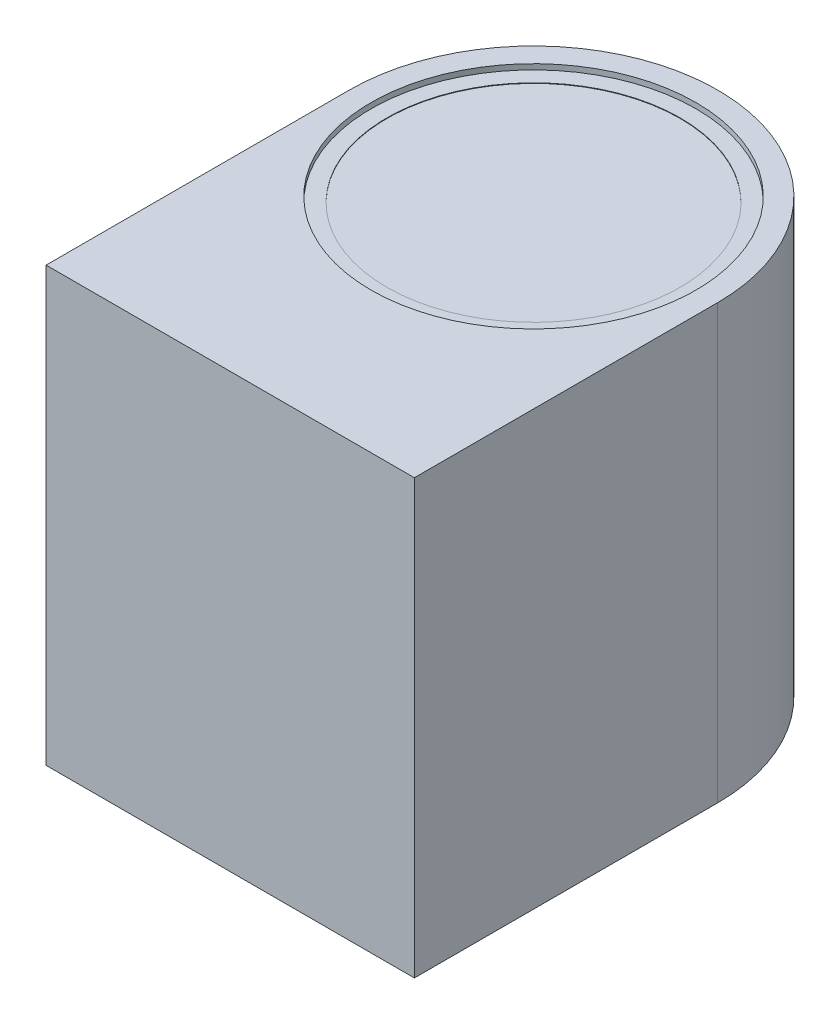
ISO-10303-21;
HEADER;
FILE_DESCRIPTION(('STEP AP214'),'2;1');
FILE_NAME('part.step','',(''),(''),'','','');
FILE_SCHEMA(('AUTOMOTIVE_DESIGN { 1 0 10303 214 1 1 1 1 }'));
ENDSEC;
DATA;
#1=APPLICATION_CONTEXT('core data for automotive mechanical design processes');
#2=APPLICATION_PROTOCOL_DEFINITION('international standard','automotive_design',2000,#1);
#3=PRODUCT_CONTEXT('',#1,'mechanical');
#4=PRODUCT('Part','Part','',(#3));
#5=PRODUCT_RELATED_PRODUCT_CATEGORY('part','',(#4));
#6=PRODUCT_DEFINITION_FORMATION('','',#4);
#7=PRODUCT_DEFINITION_CONTEXT('part definition',#1,'design');
#8=PRODUCT_DEFINITION('design','',#6,#7);
#9=PRODUCT_DEFINITION_SHAPE('','',#8);
#10=(LENGTH_UNIT() NAMED_UNIT(*) SI_UNIT(.MILLI.,.METRE.));
#11=(NAMED_UNIT(*) PLANE_ANGLE_UNIT() SI_UNIT($,.RADIAN.));
#12=(NAMED_UNIT(*) SI_UNIT($,.STERADIAN.) SOLID_ANGLE_UNIT());
#13=UNCERTAINTY_MEASURE_WITH_UNIT(LENGTH_MEASURE(1.E-05),#10,'distance_accuracy_value','');
#14=(GEOMETRIC_REPRESENTATION_CONTEXT(3) GLOBAL_UNCERTAINTY_ASSIGNED_CONTEXT((#13)) GLOBAL_UNIT_ASSIGNED_CONTEXT((#10,
#11,#12)) REPRESENTATION_CONTEXT('',''));
#15=CARTESIAN_POINT('',(0.,0.,0.));
#16=DIRECTION('',(0.,0.,1.));
#17=DIRECTION('',(1.,0.,0.));
#18=AXIS2_PLACEMENT_3D('',#15,#16,#17);
#19=CARTESIAN_POINT('',(0.,80.,0.));
#20=DIRECTION('',(0.,-1.,0.));
#21=DIRECTION('',(0.,0.,-1.));
#22=AXIS2_PLACEMENT_3D('',#19,#20,#21);
#23=CYLINDRICAL_SURFACE('',#22,34.);
#24=CARTESIAN_POINT('',(0.,0.,0.));
#25=DIRECTION('',(0.,1.,0.));
#26=DIRECTION('',(0.,0.,1.));
#27=AXIS2_PLACEMENT_3D('',#24,#25,#26);
#28=CIRCLE('',#27,34.);
#29=CARTESIAN_POINT('',(34.,0.,0.));
#30=VERTEX_POINT('',#29);
#31=CARTESIAN_POINT('',(-34.,0.,0.));
#32=VERTEX_POINT('',#31);
#33=EDGE_CURVE('E107',#30,#32,#28,.T.);
#34=ORIENTED_EDGE('',*,*,#33,.T.);
#35=DIRECTION('',(0.,-1.,0.));
#36=VECTOR('',#35,1.);
#37=CARTESIAN_POINT('',(-34.,80.,0.));
#38=LINE('',#37,#36);
#39=CARTESIAN_POINT('',(-34.,80.,0.));
#40=VERTEX_POINT('',#39);
#41=EDGE_CURVE('E11',#40,#32,#38,.T.);
#42=ORIENTED_EDGE('',*,*,#41,.F.);
#43=CARTESIAN_POINT('',(0.,80.,0.));
#44=DIRECTION('',(0.,1.,0.));
#45=DIRECTION('',(0.,0.,1.));
#46=AXIS2_PLACEMENT_3D('',#43,#44,#45);
#47=CIRCLE('',#46,34.);
#48=CARTESIAN_POINT('',(34.,80.,0.));
#49=VERTEX_POINT('',#48);
#50=EDGE_CURVE('E91',#49,#40,#47,.T.);
#51=ORIENTED_EDGE('',*,*,#50,.F.);
#52=DIRECTION('',(0.,-1.,0.));
#53=VECTOR('',#52,1.);
#54=CARTESIAN_POINT('',(34.,80.,0.));
#55=LINE('',#54,#53);
#56=EDGE_CURVE('E103',#49,#30,#55,.T.);
#57=ORIENTED_EDGE('',*,*,#56,.T.);
#58=EDGE_LOOP('',(#34,#42,#51,#57));
#59=FACE_BOUND('',#58,.T.);
#60=ADVANCED_FACE('F39',(#59),#23,.T.);
#61=CARTESIAN_POINT('',(-34.,80.,0.));
#62=DIRECTION('',(1.,0.,0.));
#63=DIRECTION('',(0.,0.,-1.));
#64=AXIS2_PLACEMENT_3D('',#61,#62,#63);
#65=PLANE('',#64);
#66=DIRECTION('',(0.,0.,1.));
#67=VECTOR('',#66,1.);
#68=CARTESIAN_POINT('',(-34.,0.,0.));
#69=LINE('',#68,#67);
#70=CARTESIAN_POINT('',(-34.,0.,56.));
#71=VERTEX_POINT('',#70);
#72=EDGE_CURVE('E96',#32,#71,#69,.T.);
#73=ORIENTED_EDGE('',*,*,#72,.T.);
#74=DIRECTION('',(0.,-1.,0.));
#75=VECTOR('',#74,1.);
#76=CARTESIAN_POINT('',(-34.,80.,56.));
#77=LINE('',#76,#75);
#78=CARTESIAN_POINT('',(-34.,80.,56.));
#79=VERTEX_POINT('',#78);
#80=EDGE_CURVE('E48',#79,#71,#77,.T.);
#81=ORIENTED_EDGE('',*,*,#80,.F.);
#82=DIRECTION('',(0.,0.,1.));
#83=VECTOR('',#82,1.);
#84=CARTESIAN_POINT('',(-34.,80.,0.));
#85=LINE('',#84,#83);
#86=EDGE_CURVE('E86',#40,#79,#85,.T.);
#87=ORIENTED_EDGE('',*,*,#86,.F.);
#88=ORIENTED_EDGE('',*,*,#41,.T.);
#89=EDGE_LOOP('',(#73,#81,#87,#88));
#90=FACE_BOUND('',#89,.T.);
#91=ADVANCED_FACE('F95',(#90),#65,.F.);
#92=CARTESIAN_POINT('',(-34.,80.,56.));
#93=DIRECTION('',(0.,0.,-1.));
#94=DIRECTION('',(-1.,0.,0.));
#95=AXIS2_PLACEMENT_3D('',#92,#93,#94);
#96=PLANE('',#95);
#97=DIRECTION('',(1.,0.,0.));
#98=VECTOR('',#97,1.);
#99=CARTESIAN_POINT('',(-34.,0.,56.));
#100=LINE('',#99,#98);
#101=CARTESIAN_POINT('',(34.,0.,56.));
#102=VERTEX_POINT('',#101);
#103=EDGE_CURVE('E73',#71,#102,#100,.T.);
#104=ORIENTED_EDGE('',*,*,#103,.T.);
#105=DIRECTION('',(0.,-1.,0.));
#106=VECTOR('',#105,1.);
#107=CARTESIAN_POINT('',(34.,80.,56.));
#108=LINE('',#107,#106);
#109=CARTESIAN_POINT('',(34.,80.,56.));
#110=VERTEX_POINT('',#109);
#111=EDGE_CURVE('E98',#110,#102,#108,.T.);
#112=ORIENTED_EDGE('',*,*,#111,.F.);
#113=DIRECTION('',(1.,0.,0.));
#114=VECTOR('',#113,1.);
#115=CARTESIAN_POINT('',(-34.,80.,56.));
#116=LINE('',#115,#114);
#117=EDGE_CURVE('E89',#79,#110,#116,.T.);
#118=ORIENTED_EDGE('',*,*,#117,.F.);
#119=ORIENTED_EDGE('',*,*,#80,.T.);
#120=EDGE_LOOP('',(#104,#112,#118,#119));
#121=FACE_BOUND('',#120,.T.);
#122=ADVANCED_FACE('F99',(#121),#96,.F.);
#123=CARTESIAN_POINT('',(34.,80.,56.));
#124=DIRECTION('',(-1.,0.,0.));
#125=DIRECTION('',(0.,0.,1.));
#126=AXIS2_PLACEMENT_3D('',#123,#124,#125);
#127=PLANE('',#126);
#128=DIRECTION('',(0.,0.,-1.));
#129=VECTOR('',#128,1.);
#130=CARTESIAN_POINT('',(34.,0.,56.));
#131=LINE('',#130,#129);
#132=EDGE_CURVE('E79',#102,#30,#131,.T.);
#133=ORIENTED_EDGE('',*,*,#132,.T.);
#134=ORIENTED_EDGE('',*,*,#56,.F.);
#135=DIRECTION('',(0.,0.,-1.));
#136=VECTOR('',#135,1.);
#137=CARTESIAN_POINT('',(34.,80.,56.));
#138=LINE('',#137,#136);
#139=EDGE_CURVE('E56',#110,#49,#138,.T.);
#140=ORIENTED_EDGE('',*,*,#139,.F.);
#141=ORIENTED_EDGE('',*,*,#111,.T.);
#142=EDGE_LOOP('',(#133,#134,#140,#141));
#143=FACE_BOUND('',#142,.T.);
#144=ADVANCED_FACE('F121',(#143),#127,.F.);
#145=CARTESIAN_POINT('',(0.,80.,0.));
#146=DIRECTION('',(0.,1.,0.));
#147=DIRECTION('',(0.,0.,1.));
#148=AXIS2_PLACEMENT_3D('',#145,#146,#147);
#149=PLANE('',#148);
#150=CARTESIAN_POINT('',(0.,80.,0.));
#151=DIRECTION('',(0.,1.,0.));
#152=DIRECTION('',(0.,0.,1.));
#153=AXIS2_PLACEMENT_3D('',#150,#151,#152);
#154=CIRCLE('',#153,30.);
#155=CARTESIAN_POINT('',(0.,80.,30.));
#156=VERTEX_POINT('',#155);
#157=EDGE_CURVE('E128',#156,#156,#154,.T.);
#158=ORIENTED_EDGE('',*,*,#157,.F.);
#159=EDGE_LOOP('',(#158));
#160=FACE_BOUND('',#159,.T.);
#161=ORIENTED_EDGE('',*,*,#50,.T.);
#162=ORIENTED_EDGE('',*,*,#86,.T.);
#163=ORIENTED_EDGE('',*,*,#117,.T.);
#164=ORIENTED_EDGE('',*,*,#139,.T.);
#165=EDGE_LOOP('',(#161,#162,#163,#164));
#166=FACE_BOUND('',#165,.T.);
#167=ADVANCED_FACE('F87',(#160,#166),#149,.T.);
#168=CARTESIAN_POINT('',(0.,0.,0.));
#169=DIRECTION('',(0.,1.,0.));
#170=DIRECTION('',(0.,0.,1.));
#171=AXIS2_PLACEMENT_3D('',#168,#169,#170);
#172=PLANE('',#171);
#173=ORIENTED_EDGE('',*,*,#33,.F.);
#174=ORIENTED_EDGE('',*,*,#132,.F.);
#175=ORIENTED_EDGE('',*,*,#103,.F.);
#176=ORIENTED_EDGE('',*,*,#72,.F.);
#177=EDGE_LOOP('',(#173,#174,#175,#176));
#178=FACE_BOUND('',#177,.T.);
#179=ADVANCED_FACE('F124',(#178),#172,.F.);
#180=CARTESIAN_POINT('',(0.,79.,0.));
#181=DIRECTION('',(0.,1.,0.));
#182=DIRECTION('',(0.,0.,1.));
#183=AXIS2_PLACEMENT_3D('',#180,#181,#182);
#184=CYLINDRICAL_SURFACE('',#183,30.);
#185=CARTESIAN_POINT('',(0.,79.,0.));
#186=DIRECTION('',(0.,1.,0.));
#187=DIRECTION('',(0.,0.,1.));
#188=AXIS2_PLACEMENT_3D('',#185,#186,#187);
#189=CIRCLE('',#188,30.);
#190=CARTESIAN_POINT('',(0.,79.,30.));
#191=VERTEX_POINT('',#190);
#192=EDGE_CURVE('E111',#191,#191,#189,.T.);
#193=ORIENTED_EDGE('',*,*,#192,.F.);
#194=EDGE_LOOP('',(#193));
#195=FACE_BOUND('',#194,.T.);
#196=ORIENTED_EDGE('',*,*,#157,.T.);
#197=EDGE_LOOP('',(#196));
#198=FACE_BOUND('',#197,.T.);
#199=ADVANCED_FACE('F155',(#195,#198),#184,.F.);
#200=CARTESIAN_POINT('',(0.,79.,0.));
#201=DIRECTION('',(0.,1.,0.));
#202=DIRECTION('',(0.,0.,1.));
#203=AXIS2_PLACEMENT_3D('',#200,#201,#202);
#204=PLANE('',#203);
#205=CARTESIAN_POINT('',(0.,79.,0.));
#206=DIRECTION('',(0.,1.,0.));
#207=DIRECTION('',(0.,0.,1.));
#208=AXIS2_PLACEMENT_3D('',#205,#206,#207);
#209=CIRCLE('',#208,27.0916851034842);
#210=CARTESIAN_POINT('',(0.,79.,27.0916851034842));
#211=VERTEX_POINT('',#210);
#212=EDGE_CURVE('E136',#211,#211,#209,.T.);
#213=ORIENTED_EDGE('',*,*,#212,.F.);
#214=EDGE_LOOP('',(#213));
#215=FACE_BOUND('',#214,.T.);
#216=ORIENTED_EDGE('',*,*,#192,.T.);
#217=EDGE_LOOP('',(#216));
#218=FACE_BOUND('',#217,.T.);
#219=ADVANCED_FACE('F149',(#215,#218),#204,.T.);
#220=CARTESIAN_POINT('',(0.,78.9,0.));
#221=DIRECTION('',(0.,1.,0.));
#222=DIRECTION('',(0.,0.,1.));
#223=AXIS2_PLACEMENT_3D('',#220,#221,#222);
#224=CYLINDRICAL_SURFACE('',#223,27.0916851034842);
#225=CARTESIAN_POINT('',(0.,78.9,0.));
#226=DIRECTION('',(0.,1.,0.));
#227=DIRECTION('',(0.,0.,1.));
#228=AXIS2_PLACEMENT_3D('',#225,#226,#227);
#229=CIRCLE('',#228,27.0916851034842);
#230=CARTESIAN_POINT('',(0.,78.9,27.0916851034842));
#231=VERTEX_POINT('',#230);
#232=EDGE_CURVE('E132',#231,#231,#229,.T.);
#233=ORIENTED_EDGE('',*,*,#232,.F.);
#234=EDGE_LOOP('',(#233));
#235=FACE_BOUND('',#234,.T.);
#236=ORIENTED_EDGE('',*,*,#212,.T.);
#237=EDGE_LOOP('',(#236));
#238=FACE_BOUND('',#237,.T.);
#239=ADVANCED_FACE('F146',(#235,#238),#224,.F.);
#240=CARTESIAN_POINT('',(0.,78.9,0.));
#241=DIRECTION('',(0.,1.,0.));
#242=DIRECTION('',(0.,0.,1.));
#243=AXIS2_PLACEMENT_3D('',#240,#241,#242);
#244=PLANE('',#243);
#245=ORIENTED_EDGE('',*,*,#232,.T.);
#246=EDGE_LOOP('',(#245));
#247=FACE_BOUND('',#246,.T.);
#248=ADVANCED_FACE('F144',(#247),#244,.T.);
#249=CLOSED_SHELL('',(#60,#91,#122,#144,#167,#179,#199,#219,#239,#248));
#250=MANIFOLD_SOLID_BREP('B2',#249);
#251=ADVANCED_BREP_SHAPE_REPRESENTATION('',(#18,#250),#14);
#252=SHAPE_DEFINITION_REPRESENTATION(#9,#251);
ENDSEC;
END-ISO-10303-21;
